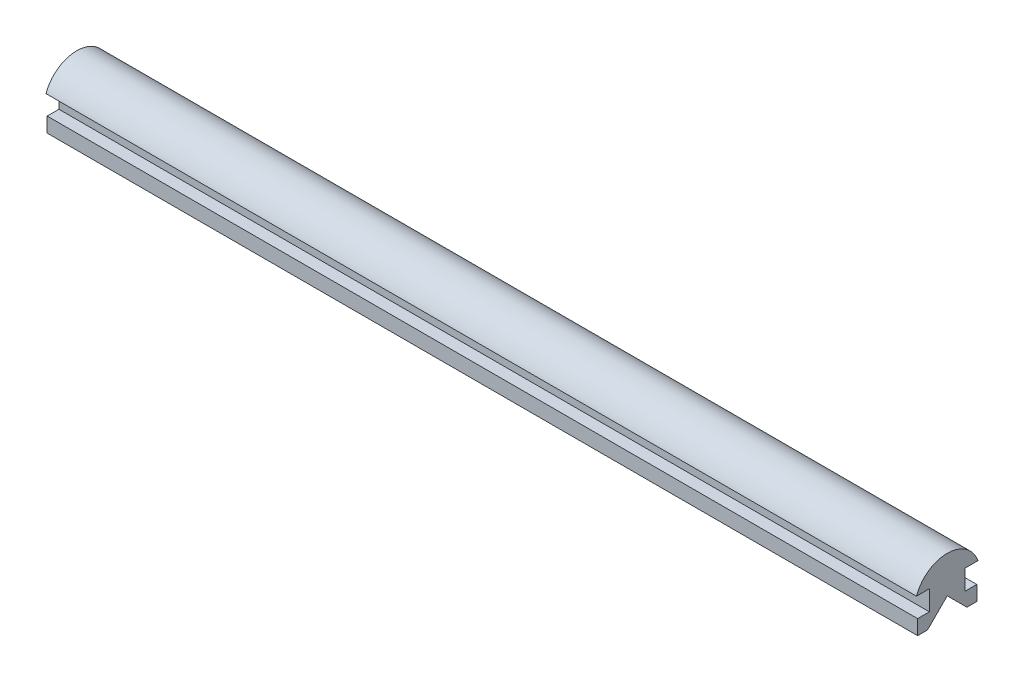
from build123d import *

# Parameters (mm, degrees)
LIUKUOHJAIMET_1_6034_LIUKUOHJAIN_PY_RE_1_DEPTH = 200


with BuildPart() as part:
    # Sketch1 → Liukuohjaimet 1.6034 LIUKUOHJAIN PY_RE_1 (new body)
    with BuildSketch(Plane(origin=(0, 0, 0), x_dir=(0, 0, -1), z_dir=(1, 0, 0))):
        with BuildLine():
            Line((-6.668894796, -2.772236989), (-6.668894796, -6.172236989))
            Line((-6.668894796, -6.172236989), (-4.397321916, -6.172236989))
            Line((-4.397321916, -6.172236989), (0.131105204, -1.643809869))
            Line((0.131105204, -1.643809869), (4.659532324, -6.172236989))
            Line((4.659532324, -6.172236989), (6.931105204, -6.172236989))
            Line((6.931105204, -6.172236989), (6.931105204, -2.772236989))
            Line((6.931105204, -2.772236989), (4.231105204, -2.772236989))
            Line((4.231105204, -2.772236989), (4.231105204, 1.827763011))
            Line((4.231105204, 1.827763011), (7.202173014, 1.827763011))
            ThreePointArc((7.202173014, 1.827763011), (0.131105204, 6.827763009), (-6.939962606, 1.827763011))
            Line((-6.939962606, 1.827763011), (-3.968894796, 1.827763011))
            Line((-3.968894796, 1.827763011), (-3.968894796, -2.772236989))
            Line((-3.968894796, -2.772236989), (-6.668894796, -2.772236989))
        make_face()
    extrude(amount=LIUKUOHJAIMET_1_6034_LIUKUOHJAIN_PY_RE_1_DEPTH)


solid = part.part
